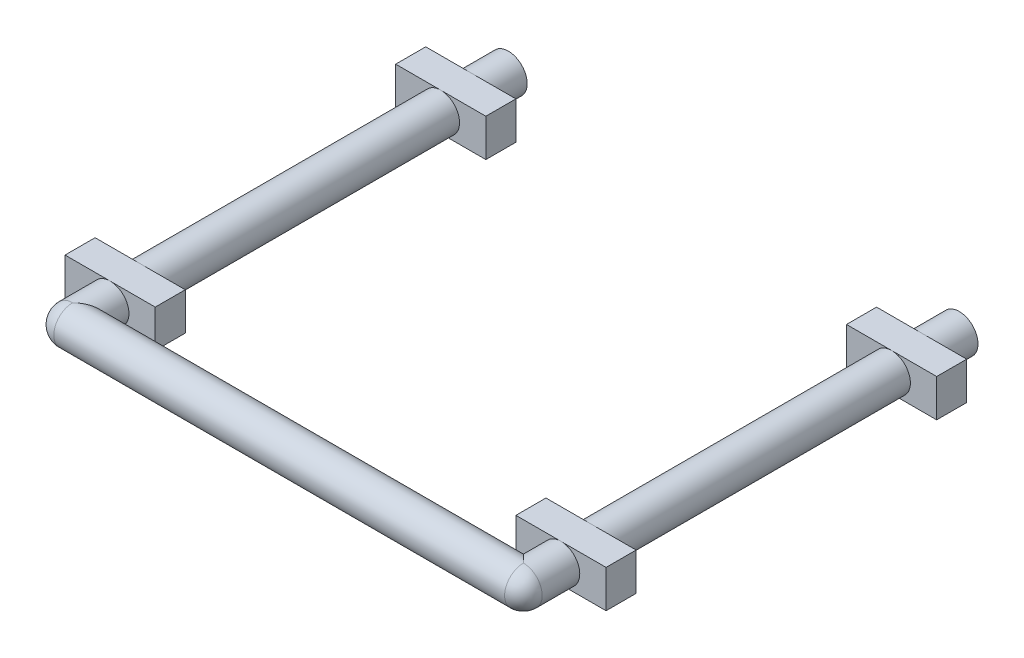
from build123d import *

# Parameters (mm, degrees)
ESQUISSE1_R          = 2.5
BASE_EXTRUSION_DEPTH = 5
ESQUISSE2_W          = 12
ESQUISSE2_H          = 5
BOSS_EXTRU_1_DEPTH   = 4
BOSS_EXTRU_2_DEPTH   = 40
ESQUISSE4_W          = 12
ESQUISSE4_H          = 5
BOSS_EXTRU_3_DEPTH   = 4
BOSS_EXTRU_4_DEPTH   = 5
ESQUISSE6_R          = 2.5
BOSS_EXTRU_5_DEPTH   = 30


with BuildPart() as part:
    # Esquisse1 → Base-Extrusion (new body)
    with BuildSketch(Plane.XY):
        Circle(ESQUISSE1_R)
    base_extrusion = extrude(amount=BASE_EXTRUSION_DEPTH)

    # Esquisse2 → Boss.-Extru.1 (add)
    with BuildSketch(Plane.XY.offset(5)):
        Rectangle(ESQUISSE2_W, ESQUISSE2_H)
    boss_extru_1 = extrude(amount=BOSS_EXTRU_1_DEPTH)

    # Esquisse3 → Boss.-Extru.2 (add)
    with BuildSketch(Plane.XY.offset(9)):
        with BuildLine():
            ThreePointArc((0, 2.5), (-2.5, 0), (0, -2.5))
            ThreePointArc((0, -2.5), (2.5, 0), (0, 2.5))
        make_face()
    boss_extru_2 = extrude(amount=BOSS_EXTRU_2_DEPTH)

    # Esquisse4 → Boss.-Extru.3 (add)
    with BuildSketch(Plane.XY.offset(49)):
        Rectangle(ESQUISSE4_W, ESQUISSE4_H)
    boss_extru_3 = extrude(amount=BOSS_EXTRU_3_DEPTH)

    # Esquisse5 → Boss.-Extru.4 (add)
    with BuildSketch(Plane.XY.offset(53)):
        with BuildLine():
            ThreePointArc((0, -2.5), (2.5, 0), (0, 2.5))
            ThreePointArc((0, 2.5), (-2.5, 0), (0, -2.5))
        make_face()
    boss_extru_4 = extrude(amount=BOSS_EXTRU_4_DEPTH)

    # Esquisse6 → Boss.-Extru.5 (add)
    with BuildSketch(Plane(origin=(0, 0, 0), x_dir=(0, 0, -1), z_dir=(1, 0, 0))):
        with Locations((-58, 0)):
            Circle(ESQUISSE6_R)
    boss_extru_5 = extrude(amount=-BOSS_EXTRU_5_DEPTH)

    # Esquisse7 → Boss.-R_vol.1 (revolve)
    with BuildSketch(Plane.XY.offset(58)):
        with BuildLine():
            Line((0, 2.5), (0, -2.5))
            ThreePointArc((0, -2.5), (2.5, 0), (0, 2.5))
        make_face()
    boss_r_vol_1 = revolve(axis=Axis((0, 5.426227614, 58), (0, -1, 0)))

    # Sym_trie5: Boss.-Extru.5, Boss.-R_vol.1 across plane
    add(boss_extru_5.mirror(Plane(origin=(-30, 0, 0), x_dir=(0, 0, 1), z_dir=(1, 0, 0))))
    add(boss_r_vol_1.mirror(Plane(origin=(-30, 0, 0), x_dir=(0, 0, 1), z_dir=(1, 0, 0))))

    # Sym_trie6: Boss.-Extru.4 across plane
    add(boss_extru_4.mirror(Plane(origin=(-30, 0, 0), x_dir=(0, 0, 1), z_dir=(1, 0, 0))))

    # Sym_trie7: Boss.-Extru.3 across plane
    add(boss_extru_3.mirror(Plane(origin=(-30, 0, 0), x_dir=(0, 0, 1), z_dir=(1, 0, 0))))

    # Sym_trie8: Boss.-Extru.2 across plane
    add(boss_extru_2.mirror(Plane(origin=(-30, 0, 0), x_dir=(0, 0, 1), z_dir=(1, 0, 0))))

    # Sym_trie9: Boss.-Extru.1 across plane
    add(boss_extru_1.mirror(Plane(origin=(-30, 0, 0), x_dir=(0, 0, 1), z_dir=(1, 0, 0))))

    # Sym_trie10: Base-Extrusion across plane
    add(base_extrusion.mirror(Plane(origin=(-30, 0, 0), x_dir=(0, 0, 1), z_dir=(1, 0, 0))))


solid = part.part
